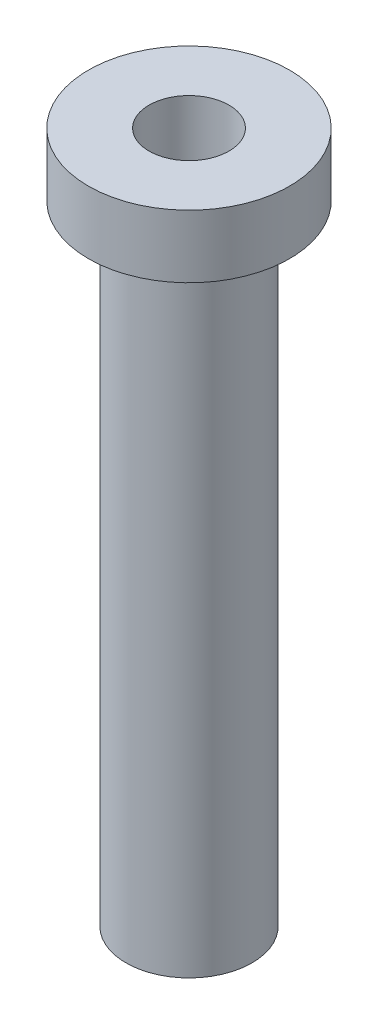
from build123d import *


with BuildPart() as part:
    # Sketch1 → Revolve1 (revolve)
    with BuildSketch(Plane.XY, mode=Mode.PRIVATE) as revolve1_sk:
        Polygon((-3.175, -50), (0, -50), (0, -55), (-5.01269, -55), (-5.01269, -5), (-8, -5), (-8, 0), (-3.175, 0), align=None)
        Polygon((0, -50), (-3.175, -48.092267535), (-3.175, -50), align=None)
    revolve(revolve1_sk.sketch.rotate(Axis((0, -55, 0), (0, 1, 0)), 270), axis=Axis((0, -55, 0), (0, 1, 0)))


solid = part.part
